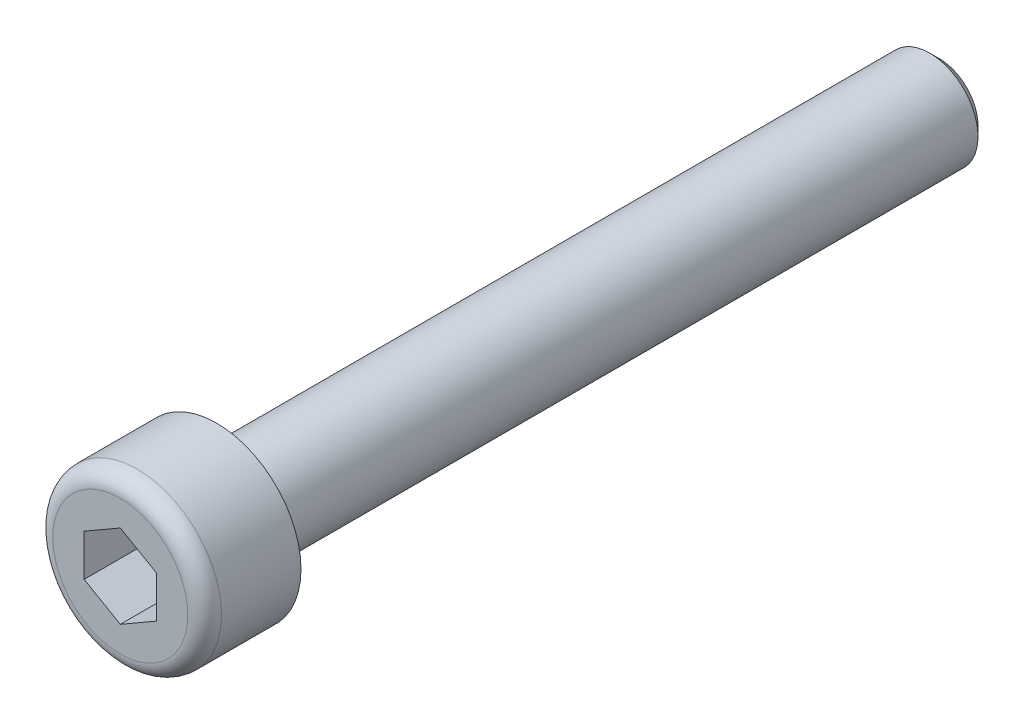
ISO-10303-21;
HEADER;
FILE_DESCRIPTION(('STEP AP214'),'2;1');
FILE_NAME('part.step','',(''),(''),'','','');
FILE_SCHEMA(('AUTOMOTIVE_DESIGN { 1 0 10303 214 1 1 1 1 }'));
ENDSEC;
DATA;
#1=APPLICATION_CONTEXT('core data for automotive mechanical design processes');
#2=APPLICATION_PROTOCOL_DEFINITION('international standard','automotive_design',2000,#1);
#3=PRODUCT_CONTEXT('',#1,'mechanical');
#4=PRODUCT('Part','Part','',(#3));
#5=PRODUCT_RELATED_PRODUCT_CATEGORY('part','',(#4));
#6=PRODUCT_DEFINITION_FORMATION('','',#4);
#7=PRODUCT_DEFINITION_CONTEXT('part definition',#1,'design');
#8=PRODUCT_DEFINITION('design','',#6,#7);
#9=PRODUCT_DEFINITION_SHAPE('','',#8);
#10=(LENGTH_UNIT() NAMED_UNIT(*) SI_UNIT(.MILLI.,.METRE.));
#11=(NAMED_UNIT(*) PLANE_ANGLE_UNIT() SI_UNIT($,.RADIAN.));
#12=(NAMED_UNIT(*) SI_UNIT($,.STERADIAN.) SOLID_ANGLE_UNIT());
#13=UNCERTAINTY_MEASURE_WITH_UNIT(LENGTH_MEASURE(1.E-05),#10,'distance_accuracy_value','');
#14=(GEOMETRIC_REPRESENTATION_CONTEXT(3) GLOBAL_UNCERTAINTY_ASSIGNED_CONTEXT((#13)) GLOBAL_UNIT_ASSIGNED_CONTEXT((#10,
#11,#12)) REPRESENTATION_CONTEXT('',''));
#15=CARTESIAN_POINT('',(0.,0.,0.));
#16=DIRECTION('',(0.,0.,1.));
#17=DIRECTION('',(1.,0.,0.));
#18=AXIS2_PLACEMENT_3D('',#15,#16,#17);
#19=CARTESIAN_POINT('',(0.,0.,30.));
#20=DIRECTION('',(0.,0.,-1.));
#21=DIRECTION('',(-1.,0.,0.));
#22=AXIS2_PLACEMENT_3D('',#19,#20,#21);
#23=CYLINDRICAL_SURFACE('',#22,2.);
#24=CARTESIAN_POINT('',(0.,0.,0.400000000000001));
#25=DIRECTION('',(0.,0.,1.));
#26=DIRECTION('',(1.,0.,0.));
#27=AXIS2_PLACEMENT_3D('',#24,#25,#26);
#28=CIRCLE('',#27,2.);
#29=CARTESIAN_POINT('',(2.,0.,0.400000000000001));
#30=VERTEX_POINT('',#29);
#31=EDGE_CURVE('E148',#30,#30,#28,.T.);
#32=ORIENTED_EDGE('',*,*,#31,.T.);
#33=EDGE_LOOP('',(#32));
#34=FACE_BOUND('',#33,.T.);
#35=CARTESIAN_POINT('',(0.,0.,30.));
#36=DIRECTION('',(0.,0.,1.));
#37=DIRECTION('',(1.,0.,0.));
#38=AXIS2_PLACEMENT_3D('',#35,#36,#37);
#39=CIRCLE('',#38,2.);
#40=CARTESIAN_POINT('',(2.,0.,30.));
#41=VERTEX_POINT('',#40);
#42=EDGE_CURVE('E145',#41,#41,#39,.T.);
#43=ORIENTED_EDGE('',*,*,#42,.F.);
#44=EDGE_LOOP('',(#43));
#45=FACE_BOUND('',#44,.T.);
#46=ADVANCED_FACE('F35',(#34,#45),#23,.T.);
#47=CARTESIAN_POINT('',(0.,0.,0.));
#48=DIRECTION('',(0.,0.,1.));
#49=DIRECTION('',(1.,0.,0.));
#50=AXIS2_PLACEMENT_3D('',#47,#48,#49);
#51=PLANE('',#50);
#52=CARTESIAN_POINT('',(0.,0.,0.));
#53=DIRECTION('',(0.,0.,1.));
#54=DIRECTION('',(1.,0.,0.));
#55=AXIS2_PLACEMENT_3D('',#52,#53,#54);
#56=CIRCLE('',#55,1.6);
#57=CARTESIAN_POINT('',(1.6,0.,0.));
#58=VERTEX_POINT('',#57);
#59=EDGE_CURVE('E151',#58,#58,#56,.F.);
#60=ORIENTED_EDGE('',*,*,#59,.T.);
#61=EDGE_LOOP('',(#60));
#62=FACE_BOUND('',#61,.T.);
#63=ADVANCED_FACE('F171',(#62),#51,.F.);
#64=CARTESIAN_POINT('',(0.,0.,30.));
#65=DIRECTION('',(0.,0.,1.));
#66=DIRECTION('',(1.,0.,0.));
#67=AXIS2_PLACEMENT_3D('',#64,#65,#66);
#68=PLANE('',#67);
#69=CARTESIAN_POINT('',(0.,0.,30.));
#70=DIRECTION('',(0.,0.,1.));
#71=DIRECTION('',(1.,0.,0.));
#72=AXIS2_PLACEMENT_3D('',#69,#70,#71);
#73=CIRCLE('',#72,3.5);
#74=CARTESIAN_POINT('',(3.5,0.,30.));
#75=VERTEX_POINT('',#74);
#76=EDGE_CURVE('E137',#75,#75,#73,.T.);
#77=ORIENTED_EDGE('',*,*,#76,.F.);
#78=EDGE_LOOP('',(#77));
#79=FACE_BOUND('',#78,.T.);
#80=ORIENTED_EDGE('',*,*,#42,.T.);
#81=EDGE_LOOP('',(#80));
#82=FACE_BOUND('',#81,.T.);
#83=ADVANCED_FACE('F177',(#79,#82),#68,.F.);
#84=CARTESIAN_POINT('',(0.,0.,34.));
#85=DIRECTION('',(0.,0.,-1.));
#86=DIRECTION('',(-1.,0.,0.));
#87=AXIS2_PLACEMENT_3D('',#84,#85,#86);
#88=CYLINDRICAL_SURFACE('',#87,3.5);
#89=CARTESIAN_POINT('',(0.,0.,33.3));
#90=DIRECTION('',(0.,0.,1.));
#91=DIRECTION('',(1.,0.,0.));
#92=AXIS2_PLACEMENT_3D('',#89,#90,#91);
#93=CIRCLE('',#92,3.5);
#94=CARTESIAN_POINT('',(3.5,0.,33.3));
#95=VERTEX_POINT('',#94);
#96=EDGE_CURVE('E11',#95,#95,#93,.F.);
#97=ORIENTED_EDGE('',*,*,#96,.T.);
#98=EDGE_LOOP('',(#97));
#99=FACE_BOUND('',#98,.T.);
#100=ORIENTED_EDGE('',*,*,#76,.T.);
#101=EDGE_LOOP('',(#100));
#102=FACE_BOUND('',#101,.T.);
#103=ADVANCED_FACE('F182',(#99,#102),#88,.T.);
#104=CARTESIAN_POINT('',(0.,0.,34.));
#105=DIRECTION('',(0.,0.,1.));
#106=DIRECTION('',(1.,0.,0.));
#107=AXIS2_PLACEMENT_3D('',#104,#105,#106);
#108=PLANE('',#107);
#109=DIRECTION('',(-0.866025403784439,0.5,0.));
#110=VECTOR('',#109,1.);
#111=CARTESIAN_POINT('',(1.5,0.866025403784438,34.));
#112=LINE('',#111,#110);
#113=CARTESIAN_POINT('',(1.5,0.866025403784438,34.));
#114=VERTEX_POINT('',#113);
#115=CARTESIAN_POINT('',(0.,1.73205080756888,34.));
#116=VERTEX_POINT('',#115);
#117=EDGE_CURVE('E50',#114,#116,#112,.T.);
#118=ORIENTED_EDGE('',*,*,#117,.F.);
#119=DIRECTION('',(0.,1.,0.));
#120=VECTOR('',#119,1.);
#121=CARTESIAN_POINT('',(1.5,-0.866025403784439,34.));
#122=LINE('',#121,#120);
#123=CARTESIAN_POINT('',(1.5,-0.866025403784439,34.));
#124=VERTEX_POINT('',#123);
#125=EDGE_CURVE('E133',#124,#114,#122,.T.);
#126=ORIENTED_EDGE('',*,*,#125,.F.);
#127=DIRECTION('',(0.866025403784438,0.5,0.));
#128=VECTOR('',#127,1.);
#129=CARTESIAN_POINT('',(0.,-1.73205080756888,34.));
#130=LINE('',#129,#128);
#131=CARTESIAN_POINT('',(0.,-1.73205080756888,34.));
#132=VERTEX_POINT('',#131);
#133=EDGE_CURVE('E131',#132,#124,#130,.T.);
#134=ORIENTED_EDGE('',*,*,#133,.F.);
#135=DIRECTION('',(0.866025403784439,-0.5,0.));
#136=VECTOR('',#135,1.);
#137=CARTESIAN_POINT('',(-1.5,-0.866025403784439,34.));
#138=LINE('',#137,#136);
#139=CARTESIAN_POINT('',(-1.5,-0.866025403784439,34.));
#140=VERTEX_POINT('',#139);
#141=EDGE_CURVE('E98',#140,#132,#138,.T.);
#142=ORIENTED_EDGE('',*,*,#141,.F.);
#143=DIRECTION('',(0.,-1.,0.));
#144=VECTOR('',#143,1.);
#145=CARTESIAN_POINT('',(-1.5,0.866025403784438,34.));
#146=LINE('',#145,#144);
#147=CARTESIAN_POINT('',(-1.5,0.866025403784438,34.));
#148=VERTEX_POINT('',#147);
#149=EDGE_CURVE('E127',#148,#140,#146,.T.);
#150=ORIENTED_EDGE('',*,*,#149,.F.);
#151=DIRECTION('',(-0.866025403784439,-0.5,0.));
#152=VECTOR('',#151,1.);
#153=CARTESIAN_POINT('',(0.,1.73205080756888,34.));
#154=LINE('',#153,#152);
#155=EDGE_CURVE('E124',#116,#148,#154,.T.);
#156=ORIENTED_EDGE('',*,*,#155,.F.);
#157=EDGE_LOOP('',(#118,#126,#134,#142,#150,#156));
#158=FACE_BOUND('',#157,.T.);
#159=CARTESIAN_POINT('',(0.,0.,34.));
#160=DIRECTION('',(0.,0.,1.));
#161=DIRECTION('',(1.,0.,0.));
#162=AXIS2_PLACEMENT_3D('',#159,#160,#161);
#163=CIRCLE('',#162,2.8);
#164=CARTESIAN_POINT('',(2.8,0.,34.));
#165=VERTEX_POINT('',#164);
#166=EDGE_CURVE('E43',#165,#165,#163,.T.);
#167=ORIENTED_EDGE('',*,*,#166,.T.);
#168=EDGE_LOOP('',(#167));
#169=FACE_BOUND('',#168,.T.);
#170=ADVANCED_FACE('F156',(#158,#169),#108,.T.);
#171=CARTESIAN_POINT('',(0.,0.,0.400000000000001));
#172=DIRECTION('',(0.,0.,1.));
#173=DIRECTION('',(1.,0.,0.));
#174=AXIS2_PLACEMENT_3D('',#171,#172,#173);
#175=CONICAL_SURFACE('',#174,2.,0.78539816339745);
#176=ORIENTED_EDGE('',*,*,#59,.F.);
#177=EDGE_LOOP('',(#176));
#178=FACE_BOUND('',#177,.T.);
#179=ORIENTED_EDGE('',*,*,#31,.F.);
#180=EDGE_LOOP('',(#179));
#181=FACE_BOUND('',#180,.T.);
#182=ADVANCED_FACE('F160',(#178,#181),#175,.T.);
#183=CARTESIAN_POINT('',(0.,0.,33.3));
#184=DIRECTION('',(0.,0.,1.));
#185=DIRECTION('',(1.,0.,0.));
#186=AXIS2_PLACEMENT_3D('',#183,#184,#185);
#187=TOROIDAL_SURFACE('',#186,2.8,0.7);
#188=ORIENTED_EDGE('',*,*,#96,.F.);
#189=EDGE_LOOP('',(#188));
#190=FACE_BOUND('',#189,.T.);
#191=ORIENTED_EDGE('',*,*,#166,.F.);
#192=EDGE_LOOP('',(#191));
#193=FACE_BOUND('',#192,.T.);
#194=ADVANCED_FACE('F37',(#190,#193),#187,.T.);
#195=CARTESIAN_POINT('',(1.5,0.866025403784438,31.5));
#196=DIRECTION('',(0.5,0.866025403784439,0.));
#197=DIRECTION('',(-0.866025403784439,0.5,0.));
#198=AXIS2_PLACEMENT_3D('',#195,#196,#197);
#199=PLANE('',#198);
#200=ORIENTED_EDGE('',*,*,#117,.T.);
#201=DIRECTION('',(0.,0.,1.));
#202=VECTOR('',#201,1.);
#203=CARTESIAN_POINT('',(0.,1.73205080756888,31.5));
#204=LINE('',#203,#202);
#205=CARTESIAN_POINT('',(0.,1.73205080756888,31.5));
#206=VERTEX_POINT('',#205);
#207=EDGE_CURVE('E80',#206,#116,#204,.T.);
#208=ORIENTED_EDGE('',*,*,#207,.F.);
#209=DIRECTION('',(-0.866025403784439,0.5,0.));
#210=VECTOR('',#209,1.);
#211=CARTESIAN_POINT('',(1.5,0.866025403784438,31.5));
#212=LINE('',#211,#210);
#213=CARTESIAN_POINT('',(1.5,0.866025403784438,31.5));
#214=VERTEX_POINT('',#213);
#215=EDGE_CURVE('E135',#214,#206,#212,.T.);
#216=ORIENTED_EDGE('',*,*,#215,.F.);
#217=DIRECTION('',(0.,0.,1.));
#218=VECTOR('',#217,1.);
#219=CARTESIAN_POINT('',(1.5,0.866025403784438,31.5));
#220=LINE('',#219,#218);
#221=EDGE_CURVE('E58',#214,#114,#220,.T.);
#222=ORIENTED_EDGE('',*,*,#221,.T.);
#223=EDGE_LOOP('',(#200,#208,#216,#222));
#224=FACE_BOUND('',#223,.T.);
#225=ADVANCED_FACE('F159',(#224),#199,.F.);
#226=CARTESIAN_POINT('',(1.5,-0.866025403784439,31.5));
#227=DIRECTION('',(1.,0.,0.));
#228=DIRECTION('',(0.,0.,-1.));
#229=AXIS2_PLACEMENT_3D('',#226,#227,#228);
#230=PLANE('',#229);
#231=ORIENTED_EDGE('',*,*,#125,.T.);
#232=ORIENTED_EDGE('',*,*,#221,.F.);
#233=DIRECTION('',(0.,1.,0.));
#234=VECTOR('',#233,1.);
#235=CARTESIAN_POINT('',(1.5,-0.866025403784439,31.5));
#236=LINE('',#235,#234);
#237=CARTESIAN_POINT('',(1.5,-0.866025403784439,31.5));
#238=VERTEX_POINT('',#237);
#239=EDGE_CURVE('E110',#238,#214,#236,.T.);
#240=ORIENTED_EDGE('',*,*,#239,.F.);
#241=DIRECTION('',(0.,0.,1.));
#242=VECTOR('',#241,1.);
#243=CARTESIAN_POINT('',(1.5,-0.866025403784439,31.5));
#244=LINE('',#243,#242);
#245=EDGE_CURVE('E102',#238,#124,#244,.T.);
#246=ORIENTED_EDGE('',*,*,#245,.T.);
#247=EDGE_LOOP('',(#231,#232,#240,#246));
#248=FACE_BOUND('',#247,.T.);
#249=ADVANCED_FACE('F166',(#248),#230,.F.);
#250=CARTESIAN_POINT('',(0.,-1.73205080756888,31.5));
#251=DIRECTION('',(0.5,-0.866025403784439,0.));
#252=DIRECTION('',(0.866025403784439,0.5,0.));
#253=AXIS2_PLACEMENT_3D('',#250,#251,#252);
#254=PLANE('',#253);
#255=ORIENTED_EDGE('',*,*,#133,.T.);
#256=ORIENTED_EDGE('',*,*,#245,.F.);
#257=DIRECTION('',(0.866025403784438,0.5,0.));
#258=VECTOR('',#257,1.);
#259=CARTESIAN_POINT('',(0.,-1.73205080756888,31.5));
#260=LINE('',#259,#258);
#261=CARTESIAN_POINT('',(0.,-1.73205080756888,31.5));
#262=VERTEX_POINT('',#261);
#263=EDGE_CURVE('E106',#262,#238,#260,.T.);
#264=ORIENTED_EDGE('',*,*,#263,.F.);
#265=DIRECTION('',(0.,0.,1.));
#266=VECTOR('',#265,1.);
#267=CARTESIAN_POINT('',(0.,-1.73205080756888,31.5));
#268=LINE('',#267,#266);
#269=EDGE_CURVE('E91',#262,#132,#268,.T.);
#270=ORIENTED_EDGE('',*,*,#269,.T.);
#271=EDGE_LOOP('',(#255,#256,#264,#270));
#272=FACE_BOUND('',#271,.T.);
#273=ADVANCED_FACE('F107',(#272),#254,.F.);
#274=CARTESIAN_POINT('',(-1.5,-0.866025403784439,31.5));
#275=DIRECTION('',(-0.5,-0.866025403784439,0.));
#276=DIRECTION('',(0.866025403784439,-0.5,0.));
#277=AXIS2_PLACEMENT_3D('',#274,#275,#276);
#278=PLANE('',#277);
#279=ORIENTED_EDGE('',*,*,#141,.T.);
#280=ORIENTED_EDGE('',*,*,#269,.F.);
#281=DIRECTION('',(0.866025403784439,-0.5,0.));
#282=VECTOR('',#281,1.);
#283=CARTESIAN_POINT('',(-1.5,-0.866025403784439,31.5));
#284=LINE('',#283,#282);
#285=CARTESIAN_POINT('',(-1.5,-0.866025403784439,31.5));
#286=VERTEX_POINT('',#285);
#287=EDGE_CURVE('E95',#286,#262,#284,.T.);
#288=ORIENTED_EDGE('',*,*,#287,.F.);
#289=DIRECTION('',(0.,0.,1.));
#290=VECTOR('',#289,1.);
#291=CARTESIAN_POINT('',(-1.5,-0.866025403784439,31.5));
#292=LINE('',#291,#290);
#293=EDGE_CURVE('E103',#286,#140,#292,.T.);
#294=ORIENTED_EDGE('',*,*,#293,.T.);
#295=EDGE_LOOP('',(#279,#280,#288,#294));
#296=FACE_BOUND('',#295,.T.);
#297=ADVANCED_FACE('F93',(#296),#278,.F.);
#298=CARTESIAN_POINT('',(-1.5,0.866025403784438,31.5));
#299=DIRECTION('',(-1.,0.,0.));
#300=DIRECTION('',(0.,-1.,0.));
#301=AXIS2_PLACEMENT_3D('',#298,#299,#300);
#302=PLANE('',#301);
#303=ORIENTED_EDGE('',*,*,#149,.T.);
#304=ORIENTED_EDGE('',*,*,#293,.F.);
#305=DIRECTION('',(0.,-1.,0.));
#306=VECTOR('',#305,1.);
#307=CARTESIAN_POINT('',(-1.5,0.866025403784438,31.5));
#308=LINE('',#307,#306);
#309=CARTESIAN_POINT('',(-1.5,0.866025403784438,31.5));
#310=VERTEX_POINT('',#309);
#311=EDGE_CURVE('E116',#310,#286,#308,.T.);
#312=ORIENTED_EDGE('',*,*,#311,.F.);
#313=DIRECTION('',(0.,0.,1.));
#314=VECTOR('',#313,1.);
#315=CARTESIAN_POINT('',(-1.5,0.866025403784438,31.5));
#316=LINE('',#315,#314);
#317=EDGE_CURVE('E140',#310,#148,#316,.T.);
#318=ORIENTED_EDGE('',*,*,#317,.T.);
#319=EDGE_LOOP('',(#303,#304,#312,#318));
#320=FACE_BOUND('',#319,.T.);
#321=ADVANCED_FACE('F195',(#320),#302,.F.);
#322=CARTESIAN_POINT('',(0.,1.73205080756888,31.5));
#323=DIRECTION('',(-0.5,0.866025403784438,0.));
#324=DIRECTION('',(-0.866025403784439,-0.5,0.));
#325=AXIS2_PLACEMENT_3D('',#322,#323,#324);
#326=PLANE('',#325);
#327=ORIENTED_EDGE('',*,*,#155,.T.);
#328=ORIENTED_EDGE('',*,*,#317,.F.);
#329=DIRECTION('',(-0.866025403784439,-0.5,0.));
#330=VECTOR('',#329,1.);
#331=CARTESIAN_POINT('',(0.,1.73205080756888,31.5));
#332=LINE('',#331,#330);
#333=EDGE_CURVE('E118',#206,#310,#332,.T.);
#334=ORIENTED_EDGE('',*,*,#333,.F.);
#335=ORIENTED_EDGE('',*,*,#207,.T.);
#336=EDGE_LOOP('',(#327,#328,#334,#335));
#337=FACE_BOUND('',#336,.T.);
#338=ADVANCED_FACE('F192',(#337),#326,.F.);
#339=CARTESIAN_POINT('',(1.5,0.866025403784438,31.5));
#340=DIRECTION('',(0.,0.,-1.));
#341=DIRECTION('',(-1.,0.,0.));
#342=AXIS2_PLACEMENT_3D('',#339,#340,#341);
#343=PLANE('',#342);
#344=ORIENTED_EDGE('',*,*,#215,.T.);
#345=ORIENTED_EDGE('',*,*,#333,.T.);
#346=ORIENTED_EDGE('',*,*,#311,.T.);
#347=ORIENTED_EDGE('',*,*,#287,.T.);
#348=ORIENTED_EDGE('',*,*,#263,.T.);
#349=ORIENTED_EDGE('',*,*,#239,.T.);
#350=EDGE_LOOP('',(#344,#345,#346,#347,#348,#349));
#351=FACE_BOUND('',#350,.T.);
#352=ADVANCED_FACE('F113',(#351),#343,.F.);
#353=CLOSED_SHELL('',(#46,#63,#83,#103,#170,#182,#194,#225,#249,#273,#297,#321,#338,#352));
#354=MANIFOLD_SOLID_BREP('B2',#353);
#355=ADVANCED_BREP_SHAPE_REPRESENTATION('',(#18,#354),#14);
#356=SHAPE_DEFINITION_REPRESENTATION(#9,#355);
ENDSEC;
END-ISO-10303-21;
